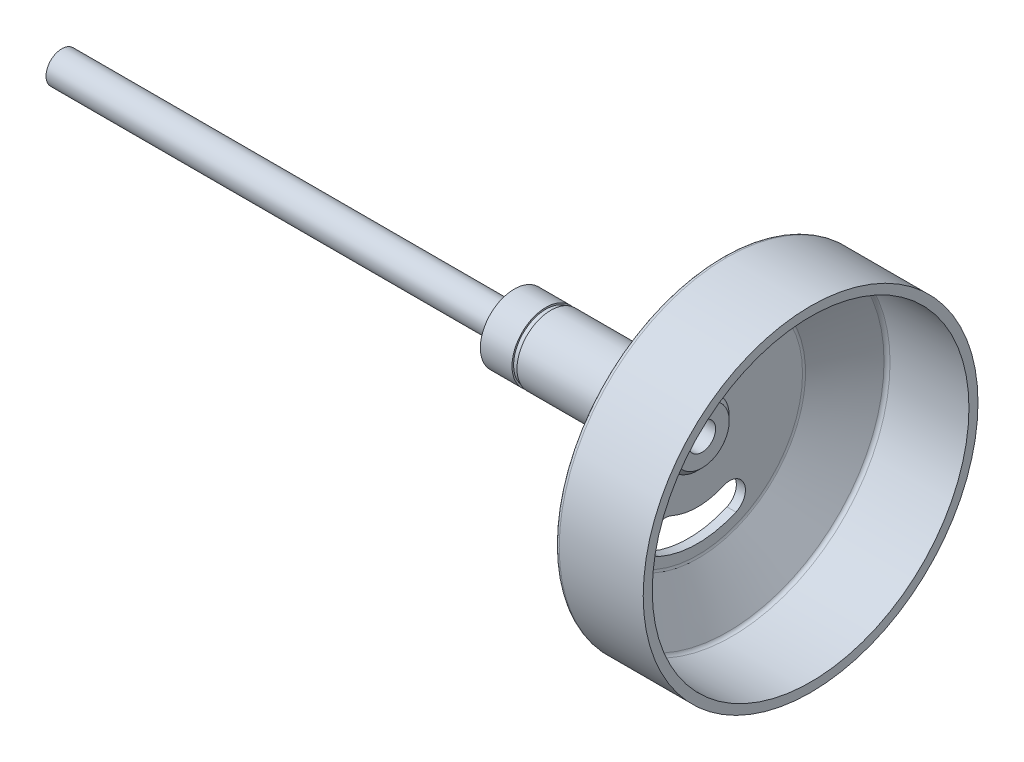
ISO-10303-21;
HEADER;
FILE_DESCRIPTION(('STEP AP214'),'2;1');
FILE_NAME('part.step','',(''),(''),'','','');
FILE_SCHEMA(('AUTOMOTIVE_DESIGN { 1 0 10303 214 1 1 1 1 }'));
ENDSEC;
DATA;
#1=APPLICATION_CONTEXT('core data for automotive mechanical design processes');
#2=APPLICATION_PROTOCOL_DEFINITION('international standard','automotive_design',2000,#1);
#3=PRODUCT_CONTEXT('',#1,'mechanical');
#4=PRODUCT('Part','Part','',(#3));
#5=PRODUCT_RELATED_PRODUCT_CATEGORY('part','',(#4));
#6=PRODUCT_DEFINITION_FORMATION('','',#4);
#7=PRODUCT_DEFINITION_CONTEXT('part definition',#1,'design');
#8=PRODUCT_DEFINITION('design','',#6,#7);
#9=PRODUCT_DEFINITION_SHAPE('','',#8);
#10=(LENGTH_UNIT() NAMED_UNIT(*) SI_UNIT(.MILLI.,.METRE.));
#11=(NAMED_UNIT(*) PLANE_ANGLE_UNIT() SI_UNIT($,.RADIAN.));
#12=(NAMED_UNIT(*) SI_UNIT($,.STERADIAN.) SOLID_ANGLE_UNIT());
#13=UNCERTAINTY_MEASURE_WITH_UNIT(LENGTH_MEASURE(1.E-05),#10,'distance_accuracy_value','');
#14=(GEOMETRIC_REPRESENTATION_CONTEXT(3) GLOBAL_UNCERTAINTY_ASSIGNED_CONTEXT((#13)) GLOBAL_UNIT_ASSIGNED_CONTEXT((#10,
#11,#12)) REPRESENTATION_CONTEXT('',''));
#15=CARTESIAN_POINT('',(0.,0.,0.));
#16=DIRECTION('',(0.,0.,1.));
#17=DIRECTION('',(1.,0.,0.));
#18=AXIS2_PLACEMENT_3D('',#15,#16,#17);
#19=CARTESIAN_POINT('',(-134.5,0.,0.));
#20=DIRECTION('',(1.,0.,0.));
#21=DIRECTION('',(0.,0.,-1.));
#22=AXIS2_PLACEMENT_3D('',#19,#20,#21);
#23=PLANE('',#22);
#24=CARTESIAN_POINT('',(-134.5,0.,0.));
#25=DIRECTION('',(-1.,0.,0.));
#26=DIRECTION('',(0.,0.,1.));
#27=AXIS2_PLACEMENT_3D('',#24,#25,#26);
#28=CIRCLE('',#27,3.5);
#29=CARTESIAN_POINT('',(-134.5,0.,3.5));
#30=VERTEX_POINT('',#29);
#31=EDGE_CURVE('E11',#30,#30,#28,.T.);
#32=ORIENTED_EDGE('',*,*,#31,.T.);
#33=EDGE_LOOP('',(#32));
#34=FACE_BOUND('',#33,.T.);
#35=ADVANCED_FACE('F35',(#34),#23,.F.);
#36=CARTESIAN_POINT('',(-9.30380149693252,0.,0.));
#37=DIRECTION('',(-1.,0.,0.));
#38=DIRECTION('',(0.,0.,1.));
#39=AXIS2_PLACEMENT_3D('',#36,#37,#38);
#40=CYLINDRICAL_SURFACE('',#39,3.50000000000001);
#41=ORIENTED_EDGE('',*,*,#31,.F.);
#42=EDGE_LOOP('',(#41));
#43=FACE_BOUND('',#42,.T.);
#44=CARTESIAN_POINT('',(-34.5,0.,0.));
#45=DIRECTION('',(-1.,0.,0.));
#46=DIRECTION('',(0.,0.,1.));
#47=AXIS2_PLACEMENT_3D('',#44,#45,#46);
#48=CIRCLE('',#47,3.50000000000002);
#49=CARTESIAN_POINT('',(-34.5,0.,3.50000000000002));
#50=VERTEX_POINT('',#49);
#51=EDGE_CURVE('E42',#50,#50,#48,.T.);
#52=ORIENTED_EDGE('',*,*,#51,.T.);
#53=EDGE_LOOP('',(#52));
#54=FACE_BOUND('',#53,.T.);
#55=ADVANCED_FACE('F240',(#43,#54),#40,.T.);
#56=CARTESIAN_POINT('',(-34.5,3.50000000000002,0.));
#57=DIRECTION('',(1.,0.,0.));
#58=DIRECTION('',(0.,0.,-1.));
#59=AXIS2_PLACEMENT_3D('',#56,#57,#58);
#60=PLANE('',#59);
#61=ORIENTED_EDGE('',*,*,#51,.F.);
#62=EDGE_LOOP('',(#61));
#63=FACE_BOUND('',#62,.T.);
#64=CARTESIAN_POINT('',(-34.5,0.,0.));
#65=DIRECTION('',(-1.,0.,0.));
#66=DIRECTION('',(0.,0.,1.));
#67=AXIS2_PLACEMENT_3D('',#64,#65,#66);
#68=CIRCLE('',#67,7.49999999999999);
#69=CARTESIAN_POINT('',(-34.5,0.,7.49999999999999));
#70=VERTEX_POINT('',#69);
#71=EDGE_CURVE('E235',#70,#70,#68,.T.);
#72=ORIENTED_EDGE('',*,*,#71,.T.);
#73=EDGE_LOOP('',(#72));
#74=FACE_BOUND('',#73,.T.);
#75=ADVANCED_FACE('F242',(#63,#74),#60,.F.);
#76=CARTESIAN_POINT('',(-9.30380149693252,0.,0.));
#77=DIRECTION('',(-1.,0.,0.));
#78=DIRECTION('',(0.,0.,1.));
#79=AXIS2_PLACEMENT_3D('',#76,#77,#78);
#80=CYLINDRICAL_SURFACE('',#79,7.5);
#81=ORIENTED_EDGE('',*,*,#71,.F.);
#82=EDGE_LOOP('',(#81));
#83=FACE_BOUND('',#82,.T.);
#84=CARTESIAN_POINT('',(-27.5,0.,0.));
#85=DIRECTION('',(-1.,0.,0.));
#86=DIRECTION('',(0.,0.,1.));
#87=AXIS2_PLACEMENT_3D('',#84,#85,#86);
#88=CIRCLE('',#87,7.5);
#89=CARTESIAN_POINT('',(-27.5,0.,7.5));
#90=VERTEX_POINT('',#89);
#91=EDGE_CURVE('E232',#90,#90,#88,.T.);
#92=ORIENTED_EDGE('',*,*,#91,.T.);
#93=EDGE_LOOP('',(#92));
#94=FACE_BOUND('',#93,.T.);
#95=ADVANCED_FACE('F245',(#83,#94),#80,.T.);
#96=CARTESIAN_POINT('',(-27.5,7.5,0.));
#97=DIRECTION('',(-1.,0.,0.));
#98=DIRECTION('',(0.,0.,1.));
#99=AXIS2_PLACEMENT_3D('',#96,#97,#98);
#100=PLANE('',#99);
#101=ORIENTED_EDGE('',*,*,#91,.F.);
#102=EDGE_LOOP('',(#101));
#103=FACE_BOUND('',#102,.T.);
#104=CARTESIAN_POINT('',(-27.5,0.,0.));
#105=DIRECTION('',(-1.,0.,0.));
#106=DIRECTION('',(0.,0.,1.));
#107=AXIS2_PLACEMENT_3D('',#104,#105,#106);
#108=CIRCLE('',#107,7.15);
#109=CARTESIAN_POINT('',(-27.5,0.,7.15));
#110=VERTEX_POINT('',#109);
#111=EDGE_CURVE('E229',#110,#110,#108,.T.);
#112=ORIENTED_EDGE('',*,*,#111,.T.);
#113=EDGE_LOOP('',(#112));
#114=FACE_BOUND('',#113,.T.);
#115=ADVANCED_FACE('F251',(#103,#114),#100,.F.);
#116=CARTESIAN_POINT('',(-9.30380149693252,0.,0.));
#117=DIRECTION('',(-1.,0.,0.));
#118=DIRECTION('',(0.,0.,1.));
#119=AXIS2_PLACEMENT_3D('',#116,#117,#118);
#120=CYLINDRICAL_SURFACE('',#119,7.15);
#121=ORIENTED_EDGE('',*,*,#111,.F.);
#122=EDGE_LOOP('',(#121));
#123=FACE_BOUND('',#122,.T.);
#124=CARTESIAN_POINT('',(-26.4,0.,0.));
#125=DIRECTION('',(-1.,0.,0.));
#126=DIRECTION('',(0.,0.,1.));
#127=AXIS2_PLACEMENT_3D('',#124,#125,#126);
#128=CIRCLE('',#127,7.15);
#129=CARTESIAN_POINT('',(-26.4,0.,7.15));
#130=VERTEX_POINT('',#129);
#131=EDGE_CURVE('E226',#130,#130,#128,.T.);
#132=ORIENTED_EDGE('',*,*,#131,.T.);
#133=EDGE_LOOP('',(#132));
#134=FACE_BOUND('',#133,.T.);
#135=ADVANCED_FACE('F257',(#123,#134),#120,.T.);
#136=CARTESIAN_POINT('',(-26.4,7.5,0.));
#137=DIRECTION('',(1.,0.,0.));
#138=DIRECTION('',(0.,0.,-1.));
#139=AXIS2_PLACEMENT_3D('',#136,#137,#138);
#140=PLANE('',#139);
#141=ORIENTED_EDGE('',*,*,#131,.F.);
#142=EDGE_LOOP('',(#141));
#143=FACE_BOUND('',#142,.T.);
#144=CARTESIAN_POINT('',(-26.4,0.,0.));
#145=DIRECTION('',(-1.,0.,0.));
#146=DIRECTION('',(0.,0.,1.));
#147=AXIS2_PLACEMENT_3D('',#144,#145,#146);
#148=CIRCLE('',#147,7.5);
#149=CARTESIAN_POINT('',(-26.4,0.,7.5));
#150=VERTEX_POINT('',#149);
#151=EDGE_CURVE('E223',#150,#150,#148,.T.);
#152=ORIENTED_EDGE('',*,*,#151,.T.);
#153=EDGE_LOOP('',(#152));
#154=FACE_BOUND('',#153,.T.);
#155=ADVANCED_FACE('F263',(#143,#154),#140,.F.);
#156=CARTESIAN_POINT('',(-9.30380149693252,0.,0.));
#157=DIRECTION('',(-1.,0.,0.));
#158=DIRECTION('',(0.,0.,1.));
#159=AXIS2_PLACEMENT_3D('',#156,#157,#158);
#160=CYLINDRICAL_SURFACE('',#159,7.50000000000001);
#161=ORIENTED_EDGE('',*,*,#151,.F.);
#162=EDGE_LOOP('',(#161));
#163=FACE_BOUND('',#162,.T.);
#164=CARTESIAN_POINT('',(-4.6,0.,0.));
#165=DIRECTION('',(-1.,0.,0.));
#166=DIRECTION('',(0.,0.,1.));
#167=AXIS2_PLACEMENT_3D('',#164,#165,#166);
#168=CIRCLE('',#167,7.50000000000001);
#169=CARTESIAN_POINT('',(-4.6,0.,7.50000000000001));
#170=VERTEX_POINT('',#169);
#171=EDGE_CURVE('E220',#170,#170,#168,.T.);
#172=ORIENTED_EDGE('',*,*,#171,.T.);
#173=EDGE_LOOP('',(#172));
#174=FACE_BOUND('',#173,.T.);
#175=ADVANCED_FACE('F269',(#163,#174),#160,.T.);
#176=CARTESIAN_POINT('',(-4.6,7.50000000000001,0.));
#177=DIRECTION('',(1.,0.,0.));
#178=DIRECTION('',(0.,0.,-1.));
#179=AXIS2_PLACEMENT_3D('',#176,#177,#178);
#180=PLANE('',#179);
#181=ORIENTED_EDGE('',*,*,#171,.F.);
#182=EDGE_LOOP('',(#181));
#183=FACE_BOUND('',#182,.T.);
#184=CARTESIAN_POINT('',(-4.6,0.,0.));
#185=DIRECTION('',(-1.,0.,0.));
#186=DIRECTION('',(0.,0.,1.));
#187=AXIS2_PLACEMENT_3D('',#184,#185,#186);
#188=CIRCLE('',#187,8.50000000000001);
#189=CARTESIAN_POINT('',(-4.6,0.,8.50000000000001));
#190=VERTEX_POINT('',#189);
#191=EDGE_CURVE('E217',#190,#190,#188,.T.);
#192=ORIENTED_EDGE('',*,*,#191,.T.);
#193=EDGE_LOOP('',(#192));
#194=FACE_BOUND('',#193,.T.);
#195=ADVANCED_FACE('F275',(#183,#194),#180,.F.);
#196=CARTESIAN_POINT('',(-9.30380149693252,0.,0.));
#197=DIRECTION('',(-1.,0.,0.));
#198=DIRECTION('',(0.,0.,1.));
#199=AXIS2_PLACEMENT_3D('',#196,#197,#198);
#200=CYLINDRICAL_SURFACE('',#199,8.50000000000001);
#201=ORIENTED_EDGE('',*,*,#191,.F.);
#202=EDGE_LOOP('',(#201));
#203=FACE_BOUND('',#202,.T.);
#204=CARTESIAN_POINT('',(4.,0.,0.));
#205=DIRECTION('',(-1.,0.,0.));
#206=DIRECTION('',(0.,0.,1.));
#207=AXIS2_PLACEMENT_3D('',#204,#205,#206);
#208=CIRCLE('',#207,8.50000000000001);
#209=CARTESIAN_POINT('',(4.,0.,8.50000000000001));
#210=VERTEX_POINT('',#209);
#211=EDGE_CURVE('E214',#210,#210,#208,.T.);
#212=ORIENTED_EDGE('',*,*,#211,.T.);
#213=EDGE_LOOP('',(#212));
#214=FACE_BOUND('',#213,.T.);
#215=ADVANCED_FACE('F281',(#203,#214),#200,.T.);
#216=CARTESIAN_POINT('',(4.,8.50000000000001,0.));
#217=DIRECTION('',(1.,0.,0.));
#218=DIRECTION('',(0.,0.,-1.));
#219=AXIS2_PLACEMENT_3D('',#216,#217,#218);
#220=PLANE('',#219);
#221=CARTESIAN_POINT('',(4.,16.,7.08872343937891));
#222=DIRECTION('',(1.,0.,0.));
#223=DIRECTION('',(0.,0.,-1.));
#224=AXIS2_PLACEMENT_3D('',#221,#222,#223);
#225=CIRCLE('',#224,3.5);
#226=CARTESIAN_POINT('',(4.,12.8,5.67097875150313));
#227=VERTEX_POINT('',#226);
#228=CARTESIAN_POINT('',(4.,19.2,8.50646812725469));
#229=VERTEX_POINT('',#228);
#230=EDGE_CURVE('E123',#227,#229,#225,.F.);
#231=ORIENTED_EDGE('',*,*,#230,.F.);
#232=CARTESIAN_POINT('',(4.,0.,0.));
#233=DIRECTION('',(1.,0.,0.));
#234=DIRECTION('',(0.,0.,-1.));
#235=AXIS2_PLACEMENT_3D('',#232,#233,#234);
#236=CIRCLE('',#235,14.);
#237=CARTESIAN_POINT('',(4.,12.8,-5.67097875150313));
#238=VERTEX_POINT('',#237);
#239=EDGE_CURVE('E103',#238,#227,#236,.T.);
#240=ORIENTED_EDGE('',*,*,#239,.F.);
#241=CARTESIAN_POINT('',(4.,16.,-7.08872343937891));
#242=DIRECTION('',(1.,0.,0.));
#243=DIRECTION('',(0.,0.,-1.));
#244=AXIS2_PLACEMENT_3D('',#241,#242,#243);
#245=CIRCLE('',#244,3.5);
#246=CARTESIAN_POINT('',(4.,19.2,-8.50646812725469));
#247=VERTEX_POINT('',#246);
#248=EDGE_CURVE('E114',#247,#238,#245,.F.);
#249=ORIENTED_EDGE('',*,*,#248,.F.);
#250=CARTESIAN_POINT('',(4.,0.,0.));
#251=DIRECTION('',(1.,0.,0.));
#252=DIRECTION('',(0.,0.,-1.));
#253=AXIS2_PLACEMENT_3D('',#250,#251,#252);
#254=CIRCLE('',#253,21.);
#255=EDGE_CURVE('E49',#229,#247,#254,.F.);
#256=ORIENTED_EDGE('',*,*,#255,.F.);
#257=EDGE_LOOP('',(#231,#240,#249,#256));
#258=FACE_BOUND('',#257,.T.);
#259=CARTESIAN_POINT('',(4.,0.,0.));
#260=DIRECTION('',(1.,0.,0.));
#261=DIRECTION('',(0.,0.,-1.));
#262=AXIS2_PLACEMENT_3D('',#259,#260,#261);
#263=CIRCLE('',#262,14.);
#264=CARTESIAN_POINT('',(4.,-12.8,5.67097875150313));
#265=VERTEX_POINT('',#264);
#266=CARTESIAN_POINT('',(4.,-12.8,-5.67097875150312));
#267=VERTEX_POINT('',#266);
#268=EDGE_CURVE('E141',#265,#267,#263,.T.);
#269=ORIENTED_EDGE('',*,*,#268,.F.);
#270=CARTESIAN_POINT('',(4.,-16.,7.08872343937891));
#271=DIRECTION('',(1.,0.,0.));
#272=DIRECTION('',(0.,0.,-1.));
#273=AXIS2_PLACEMENT_3D('',#270,#271,#272);
#274=CIRCLE('',#273,3.5);
#275=CARTESIAN_POINT('',(4.,-19.2,8.50646812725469));
#276=VERTEX_POINT('',#275);
#277=EDGE_CURVE('E144',#276,#265,#274,.F.);
#278=ORIENTED_EDGE('',*,*,#277,.F.);
#279=CARTESIAN_POINT('',(4.,0.,0.));
#280=DIRECTION('',(1.,0.,0.));
#281=DIRECTION('',(0.,0.,-1.));
#282=AXIS2_PLACEMENT_3D('',#279,#280,#281);
#283=CIRCLE('',#282,21.);
#284=CARTESIAN_POINT('',(4.,-19.2,-8.50646812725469));
#285=VERTEX_POINT('',#284);
#286=EDGE_CURVE('E161',#285,#276,#283,.F.);
#287=ORIENTED_EDGE('',*,*,#286,.F.);
#288=CARTESIAN_POINT('',(4.,-16.,-7.08872343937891));
#289=DIRECTION('',(1.,0.,0.));
#290=DIRECTION('',(0.,0.,-1.));
#291=AXIS2_PLACEMENT_3D('',#288,#289,#290);
#292=CIRCLE('',#291,3.5);
#293=EDGE_CURVE('E57',#267,#285,#292,.F.);
#294=ORIENTED_EDGE('',*,*,#293,.F.);
#295=EDGE_LOOP('',(#269,#278,#287,#294));
#296=FACE_BOUND('',#295,.T.);
#297=ORIENTED_EDGE('',*,*,#211,.F.);
#298=EDGE_LOOP('',(#297));
#299=FACE_BOUND('',#298,.T.);
#300=CARTESIAN_POINT('',(4.,0.,0.));
#301=DIRECTION('',(-1.,0.,0.));
#302=DIRECTION('',(0.,0.,1.));
#303=AXIS2_PLACEMENT_3D('',#300,#301,#302);
#304=CIRCLE('',#303,23.780416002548);
#305=CARTESIAN_POINT('',(4.,0.,23.780416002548));
#306=VERTEX_POINT('',#305);
#307=EDGE_CURVE('E211',#306,#306,#304,.T.);
#308=ORIENTED_EDGE('',*,*,#307,.T.);
#309=EDGE_LOOP('',(#308));
#310=FACE_BOUND('',#309,.T.);
#311=ADVANCED_FACE('F120',(#258,#296,#299,#310),#220,.F.);
#312=CARTESIAN_POINT('',(5.,0.,0.));
#313=DIRECTION('',(-1.,0.,0.));
#314=DIRECTION('',(0.,0.,1.));
#315=AXIS2_PLACEMENT_3D('',#312,#313,#314);
#316=TOROIDAL_SURFACE('',#315,23.780416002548,1.);
#317=ORIENTED_EDGE('',*,*,#307,.F.);
#318=EDGE_LOOP('',(#317));
#319=FACE_BOUND('',#318,.T.);
#320=CARTESIAN_POINT('',(4.14580144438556,0.,0.));
#321=DIRECTION('',(-1.,0.,0.));
#322=DIRECTION('',(0.,0.,1.));
#323=AXIS2_PLACEMENT_3D('',#320,#321,#322);
#324=CIRCLE('',#323,24.3003629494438);
#325=CARTESIAN_POINT('',(4.14580144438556,0.,24.3003629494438));
#326=VERTEX_POINT('',#325);
#327=EDGE_CURVE('E208',#326,#326,#324,.T.);
#328=ORIENTED_EDGE('',*,*,#327,.T.);
#329=EDGE_LOOP('',(#328));
#330=FACE_BOUND('',#329,.T.);
#331=ADVANCED_FACE('F292',(#319,#330),#316,.T.);
#332=CARTESIAN_POINT('',(11.5838090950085,0.,0.));
#333=DIRECTION('',(1.,0.,0.));
#334=DIRECTION('',(0.,0.,-1.));
#335=AXIS2_PLACEMENT_3D('',#332,#333,#334);
#336=CONICAL_SURFACE('',#335,36.5199469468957,1.02400748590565);
#337=ORIENTED_EDGE('',*,*,#327,.F.);
#338=EDGE_LOOP('',(#337));
#339=FACE_BOUND('',#338,.T.);
#340=CARTESIAN_POINT('',(11.5838090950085,0.,0.));
#341=DIRECTION('',(-1.,0.,0.));
#342=DIRECTION('',(0.,0.,1.));
#343=AXIS2_PLACEMENT_3D('',#340,#341,#342);
#344=CIRCLE('',#343,36.5199469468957);
#345=CARTESIAN_POINT('',(11.5838090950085,0.,36.5199469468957));
#346=VERTEX_POINT('',#345);
#347=EDGE_CURVE('E205',#346,#346,#344,.T.);
#348=ORIENTED_EDGE('',*,*,#347,.T.);
#349=EDGE_LOOP('',(#348));
#350=FACE_BOUND('',#349,.T.);
#351=ADVANCED_FACE('F298',(#339,#350),#336,.T.);
#352=CARTESIAN_POINT('',(12.4380076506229,0.,0.));
#353=DIRECTION('',(-1.,0.,0.));
#354=DIRECTION('',(0.,0.,1.));
#355=AXIS2_PLACEMENT_3D('',#352,#353,#354);
#356=TOROIDAL_SURFACE('',#355,36.,1.);
#357=ORIENTED_EDGE('',*,*,#347,.F.);
#358=EDGE_LOOP('',(#357));
#359=FACE_BOUND('',#358,.T.);
#360=CARTESIAN_POINT('',(12.4380076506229,0.,0.));
#361=DIRECTION('',(-1.,0.,0.));
#362=DIRECTION('',(0.,0.,1.));
#363=AXIS2_PLACEMENT_3D('',#360,#361,#362);
#364=CIRCLE('',#363,37.);
#365=CARTESIAN_POINT('',(12.4380076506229,0.,37.));
#366=VERTEX_POINT('',#365);
#367=EDGE_CURVE('E202',#366,#366,#364,.T.);
#368=ORIENTED_EDGE('',*,*,#367,.T.);
#369=EDGE_LOOP('',(#368));
#370=FACE_BOUND('',#369,.T.);
#371=ADVANCED_FACE('F304',(#359,#370),#356,.T.);
#372=CARTESIAN_POINT('',(-9.30380149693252,0.,0.));
#373=DIRECTION('',(-1.,0.,0.));
#374=DIRECTION('',(0.,0.,1.));
#375=AXIS2_PLACEMENT_3D('',#372,#373,#374);
#376=CYLINDRICAL_SURFACE('',#375,37.);
#377=ORIENTED_EDGE('',*,*,#367,.F.);
#378=EDGE_LOOP('',(#377));
#379=FACE_BOUND('',#378,.T.);
#380=CARTESIAN_POINT('',(31.,0.,0.));
#381=DIRECTION('',(-1.,0.,0.));
#382=DIRECTION('',(0.,0.,1.));
#383=AXIS2_PLACEMENT_3D('',#380,#381,#382);
#384=CIRCLE('',#383,37.);
#385=CARTESIAN_POINT('',(31.,0.,37.));
#386=VERTEX_POINT('',#385);
#387=EDGE_CURVE('E199',#386,#386,#384,.T.);
#388=ORIENTED_EDGE('',*,*,#387,.T.);
#389=EDGE_LOOP('',(#388));
#390=FACE_BOUND('',#389,.T.);
#391=ADVANCED_FACE('F310',(#379,#390),#376,.T.);
#392=CARTESIAN_POINT('',(31.,37.,0.));
#393=DIRECTION('',(-1.,0.,0.));
#394=DIRECTION('',(0.,0.,1.));
#395=AXIS2_PLACEMENT_3D('',#392,#393,#394);
#396=PLANE('',#395);
#397=ORIENTED_EDGE('',*,*,#387,.F.);
#398=EDGE_LOOP('',(#397));
#399=FACE_BOUND('',#398,.T.);
#400=CARTESIAN_POINT('',(31.,0.,0.));
#401=DIRECTION('',(-1.,0.,0.));
#402=DIRECTION('',(0.,0.,1.));
#403=AXIS2_PLACEMENT_3D('',#400,#401,#402);
#404=CIRCLE('',#403,35.);
#405=CARTESIAN_POINT('',(31.,0.,35.));
#406=VERTEX_POINT('',#405);
#407=EDGE_CURVE('E196',#406,#406,#404,.T.);
#408=ORIENTED_EDGE('',*,*,#407,.T.);
#409=EDGE_LOOP('',(#408));
#410=FACE_BOUND('',#409,.T.);
#411=ADVANCED_FACE('F316',(#399,#410),#396,.F.);
#412=CARTESIAN_POINT('',(-9.30380149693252,0.,0.));
#413=DIRECTION('',(-1.,0.,0.));
#414=DIRECTION('',(0.,0.,1.));
#415=AXIS2_PLACEMENT_3D('',#412,#413,#414);
#416=CYLINDRICAL_SURFACE('',#415,35.);
#417=ORIENTED_EDGE('',*,*,#407,.F.);
#418=EDGE_LOOP('',(#417));
#419=FACE_BOUND('',#418,.T.);
#420=CARTESIAN_POINT('',(13.5619923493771,0.,0.));
#421=DIRECTION('',(-1.,0.,0.));
#422=DIRECTION('',(0.,0.,1.));
#423=AXIS2_PLACEMENT_3D('',#420,#421,#422);
#424=CIRCLE('',#423,35.);
#425=CARTESIAN_POINT('',(13.5619923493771,0.,35.));
#426=VERTEX_POINT('',#425);
#427=EDGE_CURVE('E193',#426,#426,#424,.T.);
#428=ORIENTED_EDGE('',*,*,#427,.T.);
#429=EDGE_LOOP('',(#428));
#430=FACE_BOUND('',#429,.T.);
#431=ADVANCED_FACE('F322',(#419,#430),#416,.F.);
#432=CARTESIAN_POINT('',(13.5619923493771,0.,0.));
#433=DIRECTION('',(-1.,0.,0.));
#434=DIRECTION('',(0.,0.,1.));
#435=AXIS2_PLACEMENT_3D('',#432,#433,#434);
#436=TOROIDAL_SURFACE('',#435,34.,1.);
#437=ORIENTED_EDGE('',*,*,#427,.F.);
#438=EDGE_LOOP('',(#437));
#439=FACE_BOUND('',#438,.T.);
#440=CARTESIAN_POINT('',(12.7077937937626,0.,0.));
#441=DIRECTION('',(-1.,0.,0.));
#442=DIRECTION('',(0.,0.,1.));
#443=AXIS2_PLACEMENT_3D('',#440,#441,#442);
#444=CIRCLE('',#443,34.5199469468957);
#445=CARTESIAN_POINT('',(12.7077937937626,0.,34.5199469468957));
#446=VERTEX_POINT('',#445);
#447=EDGE_CURVE('E190',#446,#446,#444,.T.);
#448=ORIENTED_EDGE('',*,*,#447,.T.);
#449=EDGE_LOOP('',(#448));
#450=FACE_BOUND('',#449,.T.);
#451=ADVANCED_FACE('F328',(#439,#450),#436,.F.);
#452=CARTESIAN_POINT('',(6.14580144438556,0.,0.));
#453=DIRECTION('',(1.,0.,0.));
#454=DIRECTION('',(0.,0.,-1.));
#455=AXIS2_PLACEMENT_3D('',#452,#453,#454);
#456=CONICAL_SURFACE('',#455,23.7395309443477,1.02400748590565);
#457=ORIENTED_EDGE('',*,*,#447,.F.);
#458=EDGE_LOOP('',(#457));
#459=FACE_BOUND('',#458,.T.);
#460=CARTESIAN_POINT('',(6.14580144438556,0.,0.));
#461=DIRECTION('',(-1.,0.,0.));
#462=DIRECTION('',(0.,0.,1.));
#463=AXIS2_PLACEMENT_3D('',#460,#461,#462);
#464=CIRCLE('',#463,23.7395309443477);
#465=CARTESIAN_POINT('',(6.14580144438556,0.,23.7395309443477));
#466=VERTEX_POINT('',#465);
#467=EDGE_CURVE('E187',#466,#466,#464,.T.);
#468=ORIENTED_EDGE('',*,*,#467,.T.);
#469=EDGE_LOOP('',(#468));
#470=FACE_BOUND('',#469,.T.);
#471=ADVANCED_FACE('F334',(#459,#470),#456,.F.);
#472=CARTESIAN_POINT('',(6.99999999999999,0.,0.));
#473=DIRECTION('',(-1.,0.,0.));
#474=DIRECTION('',(0.,0.,1.));
#475=AXIS2_PLACEMENT_3D('',#472,#473,#474);
#476=TOROIDAL_SURFACE('',#475,23.219583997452,1.);
#477=ORIENTED_EDGE('',*,*,#467,.F.);
#478=EDGE_LOOP('',(#477));
#479=FACE_BOUND('',#478,.T.);
#480=CARTESIAN_POINT('',(5.99999999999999,0.,0.));
#481=DIRECTION('',(-1.,0.,0.));
#482=DIRECTION('',(0.,0.,1.));
#483=AXIS2_PLACEMENT_3D('',#480,#481,#482);
#484=CIRCLE('',#483,23.219583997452);
#485=CARTESIAN_POINT('',(5.99999999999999,0.,23.219583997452));
#486=VERTEX_POINT('',#485);
#487=EDGE_CURVE('E184',#486,#486,#484,.T.);
#488=ORIENTED_EDGE('',*,*,#487,.T.);
#489=EDGE_LOOP('',(#488));
#490=FACE_BOUND('',#489,.T.);
#491=ADVANCED_FACE('F340',(#479,#490),#476,.F.);
#492=CARTESIAN_POINT('',(6.,23.219583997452,0.));
#493=DIRECTION('',(-1.,0.,0.));
#494=DIRECTION('',(0.,0.,1.));
#495=AXIS2_PLACEMENT_3D('',#492,#493,#494);
#496=PLANE('',#495);
#497=CARTESIAN_POINT('',(6.,16.,-7.08872343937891));
#498=DIRECTION('',(1.,0.,0.));
#499=DIRECTION('',(0.,0.,-1.));
#500=AXIS2_PLACEMENT_3D('',#497,#498,#499);
#501=CIRCLE('',#500,3.5);
#502=CARTESIAN_POINT('',(6.00000000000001,12.8,-5.67097875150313));
#503=VERTEX_POINT('',#502);
#504=CARTESIAN_POINT('',(6.,19.2,-8.50646812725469));
#505=VERTEX_POINT('',#504);
#506=EDGE_CURVE('E125',#503,#505,#501,.T.);
#507=ORIENTED_EDGE('',*,*,#506,.F.);
#508=CARTESIAN_POINT('',(6.,0.,0.));
#509=DIRECTION('',(-1.,0.,0.));
#510=DIRECTION('',(0.,0.,-1.));
#511=AXIS2_PLACEMENT_3D('',#508,#509,#510);
#512=CIRCLE('',#511,14.);
#513=CARTESIAN_POINT('',(6.,12.8,5.67097875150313));
#514=VERTEX_POINT('',#513);
#515=EDGE_CURVE('E106',#514,#503,#512,.T.);
#516=ORIENTED_EDGE('',*,*,#515,.F.);
#517=CARTESIAN_POINT('',(6.,16.,7.08872343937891));
#518=DIRECTION('',(1.,0.,0.));
#519=DIRECTION('',(0.,0.,1.));
#520=AXIS2_PLACEMENT_3D('',#517,#518,#519);
#521=CIRCLE('',#520,3.5);
#522=CARTESIAN_POINT('',(6.,19.2,8.50646812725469));
#523=VERTEX_POINT('',#522);
#524=EDGE_CURVE('E111',#523,#514,#521,.T.);
#525=ORIENTED_EDGE('',*,*,#524,.F.);
#526=CARTESIAN_POINT('',(6.,0.,0.));
#527=DIRECTION('',(1.,0.,0.));
#528=DIRECTION('',(0.,0.,-1.));
#529=AXIS2_PLACEMENT_3D('',#526,#527,#528);
#530=CIRCLE('',#529,21.);
#531=EDGE_CURVE('E131',#505,#523,#530,.T.);
#532=ORIENTED_EDGE('',*,*,#531,.F.);
#533=EDGE_LOOP('',(#507,#516,#525,#532));
#534=FACE_BOUND('',#533,.T.);
#535=CARTESIAN_POINT('',(6.,0.,0.));
#536=DIRECTION('',(1.,0.,0.));
#537=DIRECTION('',(0.,0.,-1.));
#538=AXIS2_PLACEMENT_3D('',#535,#536,#537);
#539=CIRCLE('',#538,21.);
#540=CARTESIAN_POINT('',(6.00000000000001,-19.2,8.50646812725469));
#541=VERTEX_POINT('',#540);
#542=CARTESIAN_POINT('',(6.,-19.2,-8.50646812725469));
#543=VERTEX_POINT('',#542);
#544=EDGE_CURVE('E149',#541,#543,#539,.T.);
#545=ORIENTED_EDGE('',*,*,#544,.F.);
#546=CARTESIAN_POINT('',(6.,-16.,7.08872343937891));
#547=DIRECTION('',(1.,0.,0.));
#548=DIRECTION('',(0.,0.,-1.));
#549=AXIS2_PLACEMENT_3D('',#546,#547,#548);
#550=CIRCLE('',#549,3.5);
#551=CARTESIAN_POINT('',(6.,-12.8,5.67097875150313));
#552=VERTEX_POINT('',#551);
#553=EDGE_CURVE('E147',#552,#541,#550,.T.);
#554=ORIENTED_EDGE('',*,*,#553,.F.);
#555=CARTESIAN_POINT('',(6.,0.,0.));
#556=DIRECTION('',(-1.,0.,0.));
#557=DIRECTION('',(0.,0.,-1.));
#558=AXIS2_PLACEMENT_3D('',#555,#556,#557);
#559=CIRCLE('',#558,14.);
#560=CARTESIAN_POINT('',(6.,-12.8,-5.67097875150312));
#561=VERTEX_POINT('',#560);
#562=EDGE_CURVE('E155',#561,#552,#559,.T.);
#563=ORIENTED_EDGE('',*,*,#562,.F.);
#564=CARTESIAN_POINT('',(6.,-16.,-7.08872343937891));
#565=DIRECTION('',(1.,0.,0.));
#566=DIRECTION('',(0.,0.,1.));
#567=AXIS2_PLACEMENT_3D('',#564,#565,#566);
#568=CIRCLE('',#567,3.5);
#569=EDGE_CURVE('E152',#543,#561,#568,.T.);
#570=ORIENTED_EDGE('',*,*,#569,.F.);
#571=EDGE_LOOP('',(#545,#554,#563,#570));
#572=FACE_BOUND('',#571,.T.);
#573=ORIENTED_EDGE('',*,*,#487,.F.);
#574=EDGE_LOOP('',(#573));
#575=FACE_BOUND('',#574,.T.);
#576=CARTESIAN_POINT('',(6.,0.,0.));
#577=DIRECTION('',(-1.,0.,0.));
#578=DIRECTION('',(0.,0.,1.));
#579=AXIS2_PLACEMENT_3D('',#576,#577,#578);
#580=CIRCLE('',#579,7.);
#581=CARTESIAN_POINT('',(6.,0.,7.));
#582=VERTEX_POINT('',#581);
#583=EDGE_CURVE('E181',#582,#582,#580,.T.);
#584=ORIENTED_EDGE('',*,*,#583,.T.);
#585=EDGE_LOOP('',(#584));
#586=FACE_BOUND('',#585,.T.);
#587=ADVANCED_FACE('F346',(#534,#572,#575,#586),#496,.F.);
#588=CARTESIAN_POINT('',(-9.30380149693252,0.,0.));
#589=DIRECTION('',(-1.,0.,0.));
#590=DIRECTION('',(0.,0.,1.));
#591=AXIS2_PLACEMENT_3D('',#588,#589,#590);
#592=CYLINDRICAL_SURFACE('',#591,7.);
#593=ORIENTED_EDGE('',*,*,#583,.F.);
#594=EDGE_LOOP('',(#593));
#595=FACE_BOUND('',#594,.T.);
#596=CARTESIAN_POINT('',(6.01,0.,0.));
#597=DIRECTION('',(-1.,0.,0.));
#598=DIRECTION('',(0.,0.,1.));
#599=AXIS2_PLACEMENT_3D('',#596,#597,#598);
#600=CIRCLE('',#599,7.);
#601=CARTESIAN_POINT('',(6.01,0.,7.));
#602=VERTEX_POINT('',#601);
#603=EDGE_CURVE('E178',#602,#602,#600,.T.);
#604=ORIENTED_EDGE('',*,*,#603,.T.);
#605=EDGE_LOOP('',(#604));
#606=FACE_BOUND('',#605,.T.);
#607=ADVANCED_FACE('F352',(#595,#606),#592,.T.);
#608=CARTESIAN_POINT('',(7.,0.,0.));
#609=DIRECTION('',(-1.,0.,0.));
#610=DIRECTION('',(0.,0.,1.));
#611=AXIS2_PLACEMENT_3D('',#608,#609,#610);
#612=CONICAL_SURFACE('',#611,6.01,0.785398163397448);
#613=ORIENTED_EDGE('',*,*,#603,.F.);
#614=EDGE_LOOP('',(#613));
#615=FACE_BOUND('',#614,.T.);
#616=CARTESIAN_POINT('',(7.,0.,0.));
#617=DIRECTION('',(-1.,0.,0.));
#618=DIRECTION('',(0.,0.,1.));
#619=AXIS2_PLACEMENT_3D('',#616,#617,#618);
#620=CIRCLE('',#619,6.01);
#621=CARTESIAN_POINT('',(7.,0.,6.01));
#622=VERTEX_POINT('',#621);
#623=EDGE_CURVE('E175',#622,#622,#620,.T.);
#624=ORIENTED_EDGE('',*,*,#623,.T.);
#625=EDGE_LOOP('',(#624));
#626=FACE_BOUND('',#625,.T.);
#627=ADVANCED_FACE('F359',(#615,#626),#612,.T.);
#628=CARTESIAN_POINT('',(7.,6.01,0.));
#629=DIRECTION('',(-1.,0.,0.));
#630=DIRECTION('',(0.,0.,1.));
#631=AXIS2_PLACEMENT_3D('',#628,#629,#630);
#632=PLANE('',#631);
#633=ORIENTED_EDGE('',*,*,#623,.F.);
#634=EDGE_LOOP('',(#633));
#635=FACE_BOUND('',#634,.T.);
#636=CARTESIAN_POINT('',(7.,0.,0.));
#637=DIRECTION('',(-1.,0.,0.));
#638=DIRECTION('',(0.,0.,1.));
#639=AXIS2_PLACEMENT_3D('',#636,#637,#638);
#640=CIRCLE('',#639,3.);
#641=CARTESIAN_POINT('',(7.,0.,3.));
#642=VERTEX_POINT('',#641);
#643=EDGE_CURVE('E172',#642,#642,#640,.T.);
#644=ORIENTED_EDGE('',*,*,#643,.T.);
#645=EDGE_LOOP('',(#644));
#646=FACE_BOUND('',#645,.T.);
#647=ADVANCED_FACE('F365',(#635,#646),#632,.F.);
#648=CARTESIAN_POINT('',(-9.30380149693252,0.,0.));
#649=DIRECTION('',(-1.,0.,0.));
#650=DIRECTION('',(0.,0.,1.));
#651=AXIS2_PLACEMENT_3D('',#648,#649,#650);
#652=CYLINDRICAL_SURFACE('',#651,3.);
#653=ORIENTED_EDGE('',*,*,#643,.F.);
#654=EDGE_LOOP('',(#653));
#655=FACE_BOUND('',#654,.T.);
#656=CARTESIAN_POINT('',(0.,0.,0.));
#657=DIRECTION('',(-1.,0.,0.));
#658=DIRECTION('',(0.,0.,1.));
#659=AXIS2_PLACEMENT_3D('',#656,#657,#658);
#660=CIRCLE('',#659,3.);
#661=CARTESIAN_POINT('',(0.,0.,3.));
#662=VERTEX_POINT('',#661);
#663=EDGE_CURVE('E117',#662,#662,#660,.T.);
#664=ORIENTED_EDGE('',*,*,#663,.T.);
#665=EDGE_LOOP('',(#664));
#666=FACE_BOUND('',#665,.T.);
#667=ADVANCED_FACE('F371',(#655,#666),#652,.F.);
#668=CARTESIAN_POINT('',(0.,3.,0.));
#669=DIRECTION('',(-1.,0.,0.));
#670=DIRECTION('',(0.,0.,1.));
#671=AXIS2_PLACEMENT_3D('',#668,#669,#670);
#672=PLANE('',#671);
#673=ORIENTED_EDGE('',*,*,#663,.F.);
#674=EDGE_LOOP('',(#673));
#675=FACE_BOUND('',#674,.T.);
#676=ADVANCED_FACE('F377',(#675),#672,.F.);
#677=CARTESIAN_POINT('',(-134.501,-16.,7.08872343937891));
#678=DIRECTION('',(1.,0.,0.));
#679=DIRECTION('',(0.,0.,-1.));
#680=AXIS2_PLACEMENT_3D('',#677,#678,#679);
#681=CYLINDRICAL_SURFACE('',#680,3.5);
#682=ORIENTED_EDGE('',*,*,#277,.T.);
#683=DIRECTION('',(1.,0.,0.));
#684=VECTOR('',#683,1.);
#685=CARTESIAN_POINT('',(-134.501,-12.8,5.67097875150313));
#686=LINE('',#685,#684);
#687=EDGE_CURVE('E159',#265,#552,#686,.T.);
#688=ORIENTED_EDGE('',*,*,#687,.T.);
#689=ORIENTED_EDGE('',*,*,#553,.T.);
#690=DIRECTION('',(1.,0.,0.));
#691=VECTOR('',#690,1.);
#692=CARTESIAN_POINT('',(-134.501,-19.2,8.50646812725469));
#693=LINE('',#692,#691);
#694=EDGE_CURVE('E158',#276,#541,#693,.T.);
#695=ORIENTED_EDGE('',*,*,#694,.F.);
#696=EDGE_LOOP('',(#682,#688,#689,#695));
#697=FACE_BOUND('',#696,.T.);
#698=ADVANCED_FACE('F382',(#697),#681,.F.);
#699=CARTESIAN_POINT('',(-134.501,0.,0.));
#700=DIRECTION('',(1.,0.,0.));
#701=DIRECTION('',(0.,0.,-1.));
#702=AXIS2_PLACEMENT_3D('',#699,#700,#701);
#703=CYLINDRICAL_SURFACE('',#702,14.);
#704=ORIENTED_EDGE('',*,*,#268,.T.);
#705=DIRECTION('',(1.,0.,0.));
#706=VECTOR('',#705,1.);
#707=CARTESIAN_POINT('',(-134.501,-12.8,-5.67097875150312));
#708=LINE('',#707,#706);
#709=EDGE_CURVE('E162',#267,#561,#708,.T.);
#710=ORIENTED_EDGE('',*,*,#709,.T.);
#711=ORIENTED_EDGE('',*,*,#562,.T.);
#712=ORIENTED_EDGE('',*,*,#687,.F.);
#713=EDGE_LOOP('',(#704,#710,#711,#712));
#714=FACE_BOUND('',#713,.T.);
#715=ADVANCED_FACE('F387',(#714),#703,.T.);
#716=CARTESIAN_POINT('',(-134.501,-16.,-7.08872343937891));
#717=DIRECTION('',(1.,0.,0.));
#718=DIRECTION('',(0.,0.,-1.));
#719=AXIS2_PLACEMENT_3D('',#716,#717,#718);
#720=CYLINDRICAL_SURFACE('',#719,3.5);
#721=ORIENTED_EDGE('',*,*,#293,.T.);
#722=DIRECTION('',(1.,0.,0.));
#723=VECTOR('',#722,1.);
#724=CARTESIAN_POINT('',(-134.501,-19.2,-8.50646812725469));
#725=LINE('',#724,#723);
#726=EDGE_CURVE('E164',#285,#543,#725,.T.);
#727=ORIENTED_EDGE('',*,*,#726,.T.);
#728=ORIENTED_EDGE('',*,*,#569,.T.);
#729=ORIENTED_EDGE('',*,*,#709,.F.);
#730=EDGE_LOOP('',(#721,#727,#728,#729));
#731=FACE_BOUND('',#730,.T.);
#732=ADVANCED_FACE('F527',(#731),#720,.F.);
#733=CARTESIAN_POINT('',(-134.501,0.,0.));
#734=DIRECTION('',(1.,0.,0.));
#735=DIRECTION('',(0.,0.,-1.));
#736=AXIS2_PLACEMENT_3D('',#733,#734,#735);
#737=CYLINDRICAL_SURFACE('',#736,21.);
#738=ORIENTED_EDGE('',*,*,#286,.T.);
#739=ORIENTED_EDGE('',*,*,#694,.T.);
#740=ORIENTED_EDGE('',*,*,#544,.T.);
#741=ORIENTED_EDGE('',*,*,#726,.F.);
#742=EDGE_LOOP('',(#738,#739,#740,#741));
#743=FACE_BOUND('',#742,.T.);
#744=ADVANCED_FACE('F538',(#743),#737,.F.);
#745=CARTESIAN_POINT('',(-134.501,0.,0.));
#746=DIRECTION('',(1.,0.,0.));
#747=DIRECTION('',(0.,0.,-1.));
#748=AXIS2_PLACEMENT_3D('',#745,#746,#747);
#749=CYLINDRICAL_SURFACE('',#748,14.);
#750=ORIENTED_EDGE('',*,*,#239,.T.);
#751=DIRECTION('',(1.,0.,0.));
#752=VECTOR('',#751,1.);
#753=CARTESIAN_POINT('',(-134.501,12.8,5.67097875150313));
#754=LINE('',#753,#752);
#755=EDGE_CURVE('E118',#227,#514,#754,.T.);
#756=ORIENTED_EDGE('',*,*,#755,.T.);
#757=ORIENTED_EDGE('',*,*,#515,.T.);
#758=DIRECTION('',(1.,0.,0.));
#759=VECTOR('',#758,1.);
#760=CARTESIAN_POINT('',(-134.501,12.8,-5.67097875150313));
#761=LINE('',#760,#759);
#762=EDGE_CURVE('E99',#238,#503,#761,.T.);
#763=ORIENTED_EDGE('',*,*,#762,.F.);
#764=EDGE_LOOP('',(#750,#756,#757,#763));
#765=FACE_BOUND('',#764,.T.);
#766=ADVANCED_FACE('F101',(#765),#749,.T.);
#767=CARTESIAN_POINT('',(-134.501,16.,7.08872343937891));
#768=DIRECTION('',(1.,0.,0.));
#769=DIRECTION('',(0.,0.,-1.));
#770=AXIS2_PLACEMENT_3D('',#767,#768,#769);
#771=CYLINDRICAL_SURFACE('',#770,3.5);
#772=ORIENTED_EDGE('',*,*,#230,.T.);
#773=DIRECTION('',(1.,0.,0.));
#774=VECTOR('',#773,1.);
#775=CARTESIAN_POINT('',(-134.501,19.2,8.50646812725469));
#776=LINE('',#775,#774);
#777=EDGE_CURVE('E137',#229,#523,#776,.T.);
#778=ORIENTED_EDGE('',*,*,#777,.T.);
#779=ORIENTED_EDGE('',*,*,#524,.T.);
#780=ORIENTED_EDGE('',*,*,#755,.F.);
#781=EDGE_LOOP('',(#772,#778,#779,#780));
#782=FACE_BOUND('',#781,.T.);
#783=ADVANCED_FACE('F557',(#782),#771,.F.);
#784=CARTESIAN_POINT('',(-134.501,0.,0.));
#785=DIRECTION('',(1.,0.,0.));
#786=DIRECTION('',(0.,0.,-1.));
#787=AXIS2_PLACEMENT_3D('',#784,#785,#786);
#788=CYLINDRICAL_SURFACE('',#787,21.);
#789=ORIENTED_EDGE('',*,*,#255,.T.);
#790=DIRECTION('',(1.,0.,0.));
#791=VECTOR('',#790,1.);
#792=CARTESIAN_POINT('',(-134.501,19.2,-8.50646812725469));
#793=LINE('',#792,#791);
#794=EDGE_CURVE('E110',#247,#505,#793,.T.);
#795=ORIENTED_EDGE('',*,*,#794,.T.);
#796=ORIENTED_EDGE('',*,*,#531,.T.);
#797=ORIENTED_EDGE('',*,*,#777,.F.);
#798=EDGE_LOOP('',(#789,#795,#796,#797));
#799=FACE_BOUND('',#798,.T.);
#800=ADVANCED_FACE('F567',(#799),#788,.F.);
#801=CARTESIAN_POINT('',(-134.501,16.,-7.08872343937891));
#802=DIRECTION('',(1.,0.,0.));
#803=DIRECTION('',(0.,0.,-1.));
#804=AXIS2_PLACEMENT_3D('',#801,#802,#803);
#805=CYLINDRICAL_SURFACE('',#804,3.5);
#806=ORIENTED_EDGE('',*,*,#248,.T.);
#807=ORIENTED_EDGE('',*,*,#762,.T.);
#808=ORIENTED_EDGE('',*,*,#506,.T.);
#809=ORIENTED_EDGE('',*,*,#794,.F.);
#810=EDGE_LOOP('',(#806,#807,#808,#809));
#811=FACE_BOUND('',#810,.T.);
#812=ADVANCED_FACE('F115',(#811),#805,.F.);
#813=CLOSED_SHELL('',(#35,#55,#75,#95,#115,#135,#155,#175,#195,#215,#311,#331,#351,#371,#391,
#411,#431,#451,#471,#491,#587,#607,#627,#647,#667,#676,#698,#715,#732,#744,#766,#783,#800,#812));
#814=MANIFOLD_SOLID_BREP('B2',#813);
#815=ADVANCED_BREP_SHAPE_REPRESENTATION('',(#18,#814),#14);
#816=SHAPE_DEFINITION_REPRESENTATION(#9,#815);
ENDSEC;
END-ISO-10303-21;
